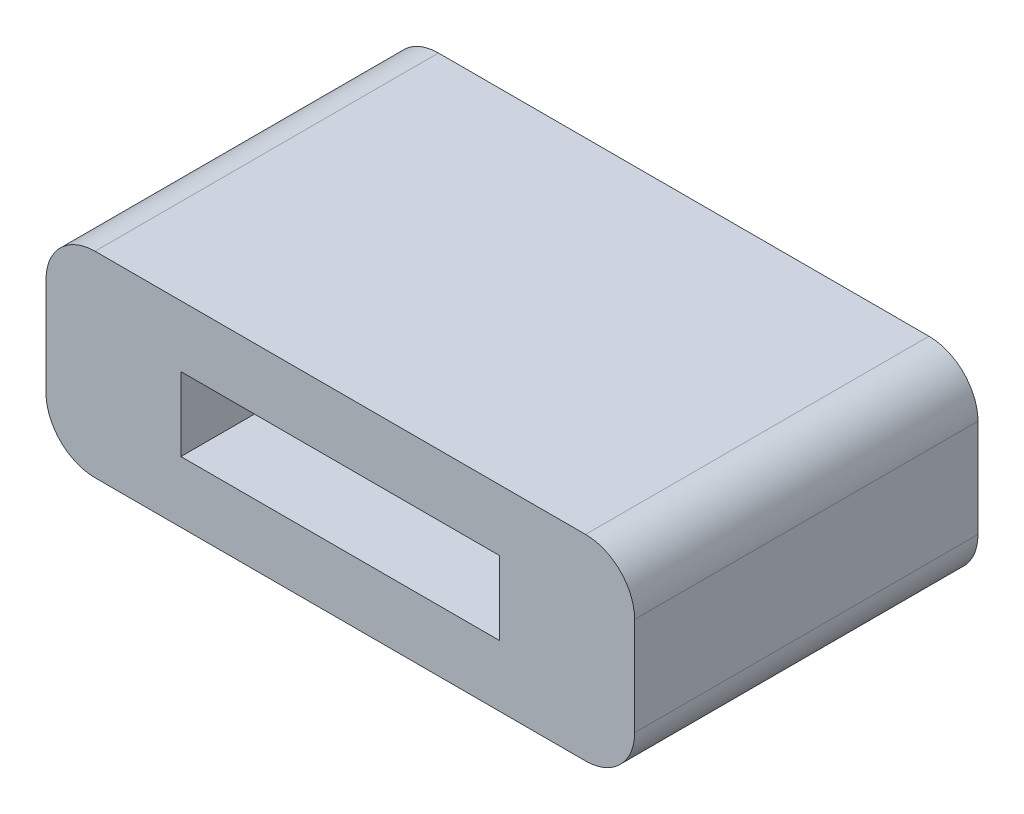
ISO-10303-21;
HEADER;
FILE_DESCRIPTION(('STEP AP214'),'2;1');
FILE_NAME('part.step','',(''),(''),'','','');
FILE_SCHEMA(('AUTOMOTIVE_DESIGN { 1 0 10303 214 1 1 1 1 }'));
ENDSEC;
DATA;
#1=APPLICATION_CONTEXT('core data for automotive mechanical design processes');
#2=APPLICATION_PROTOCOL_DEFINITION('international standard','automotive_design',2000,#1);
#3=PRODUCT_CONTEXT('',#1,'mechanical');
#4=PRODUCT('Part','Part','',(#3));
#5=PRODUCT_RELATED_PRODUCT_CATEGORY('part','',(#4));
#6=PRODUCT_DEFINITION_FORMATION('','',#4);
#7=PRODUCT_DEFINITION_CONTEXT('part definition',#1,'design');
#8=PRODUCT_DEFINITION('design','',#6,#7);
#9=PRODUCT_DEFINITION_SHAPE('','',#8);
#10=(LENGTH_UNIT() NAMED_UNIT(*) SI_UNIT(.MILLI.,.METRE.));
#11=(NAMED_UNIT(*) PLANE_ANGLE_UNIT() SI_UNIT($,.RADIAN.));
#12=(NAMED_UNIT(*) SI_UNIT($,.STERADIAN.) SOLID_ANGLE_UNIT());
#13=UNCERTAINTY_MEASURE_WITH_UNIT(LENGTH_MEASURE(1.E-05),#10,'distance_accuracy_value','');
#14=(GEOMETRIC_REPRESENTATION_CONTEXT(3) GLOBAL_UNCERTAINTY_ASSIGNED_CONTEXT((#13)) GLOBAL_UNIT_ASSIGNED_CONTEXT((#10,
#11,#12)) REPRESENTATION_CONTEXT('',''));
#15=CARTESIAN_POINT('',(0.,0.,0.));
#16=DIRECTION('',(0.,0.,1.));
#17=DIRECTION('',(1.,0.,0.));
#18=AXIS2_PLACEMENT_3D('',#15,#16,#17);
#19=CARTESIAN_POINT('',(-5.,1.,-7.));
#20=DIRECTION('',(0.,0.,1.));
#21=DIRECTION('',(1.,0.,0.));
#22=AXIS2_PLACEMENT_3D('',#19,#20,#21);
#23=PLANE('',#22);
#24=CARTESIAN_POINT('',(-5.,1.,-7.));
#25=DIRECTION('',(0.,0.,1.));
#26=DIRECTION('',(1.,0.,0.));
#27=AXIS2_PLACEMENT_3D('',#24,#25,#26);
#28=CIRCLE('',#27,1.);
#29=CARTESIAN_POINT('',(-5.,2.,-7.));
#30=VERTEX_POINT('',#29);
#31=CARTESIAN_POINT('',(-6.,1.,-7.));
#32=VERTEX_POINT('',#31);
#33=EDGE_CURVE('E212',#30,#32,#28,.T.);
#34=ORIENTED_EDGE('',*,*,#33,.F.);
#35=DIRECTION('',(-1.,0.,0.));
#36=VECTOR('',#35,1.);
#37=CARTESIAN_POINT('',(-5.,2.,-7.));
#38=LINE('',#37,#36);
#39=CARTESIAN_POINT('',(5.,2.,-7.));
#40=VERTEX_POINT('',#39);
#41=EDGE_CURVE('E233',#40,#30,#38,.T.);
#42=ORIENTED_EDGE('',*,*,#41,.F.);
#43=CARTESIAN_POINT('',(5.,1.,-7.));
#44=DIRECTION('',(0.,0.,1.));
#45=DIRECTION('',(-1.,0.,0.));
#46=AXIS2_PLACEMENT_3D('',#43,#44,#45);
#47=CIRCLE('',#46,1.);
#48=CARTESIAN_POINT('',(6.,1.,-7.));
#49=VERTEX_POINT('',#48);
#50=EDGE_CURVE('E230',#49,#40,#47,.T.);
#51=ORIENTED_EDGE('',*,*,#50,.F.);
#52=DIRECTION('',(0.,1.,0.));
#53=VECTOR('',#52,1.);
#54=CARTESIAN_POINT('',(6.,1.,-7.));
#55=LINE('',#54,#53);
#56=CARTESIAN_POINT('',(6.,-1.,-7.));
#57=VERTEX_POINT('',#56);
#58=EDGE_CURVE('E227',#57,#49,#55,.T.);
#59=ORIENTED_EDGE('',*,*,#58,.F.);
#60=CARTESIAN_POINT('',(5.,-1.,-7.));
#61=DIRECTION('',(0.,0.,1.));
#62=DIRECTION('',(1.,0.,0.));
#63=AXIS2_PLACEMENT_3D('',#60,#61,#62);
#64=CIRCLE('',#63,1.);
#65=CARTESIAN_POINT('',(5.,-2.,-7.));
#66=VERTEX_POINT('',#65);
#67=EDGE_CURVE('E224',#66,#57,#64,.T.);
#68=ORIENTED_EDGE('',*,*,#67,.F.);
#69=DIRECTION('',(1.,0.,0.));
#70=VECTOR('',#69,1.);
#71=CARTESIAN_POINT('',(-5.,-2.,-7.));
#72=LINE('',#71,#70);
#73=CARTESIAN_POINT('',(-5.,-2.,-7.));
#74=VERTEX_POINT('',#73);
#75=EDGE_CURVE('E221',#74,#66,#72,.T.);
#76=ORIENTED_EDGE('',*,*,#75,.F.);
#77=CARTESIAN_POINT('',(-5.,-1.,-7.));
#78=DIRECTION('',(0.,0.,1.));
#79=DIRECTION('',(1.,0.,0.));
#80=AXIS2_PLACEMENT_3D('',#77,#78,#79);
#81=CIRCLE('',#80,1.);
#82=CARTESIAN_POINT('',(-6.,-1.,-7.));
#83=VERTEX_POINT('',#82);
#84=EDGE_CURVE('E218',#83,#74,#81,.T.);
#85=ORIENTED_EDGE('',*,*,#84,.F.);
#86=DIRECTION('',(0.,-1.,0.));
#87=VECTOR('',#86,1.);
#88=CARTESIAN_POINT('',(-6.,1.,-7.));
#89=LINE('',#88,#87);
#90=EDGE_CURVE('E215',#32,#83,#89,.T.);
#91=ORIENTED_EDGE('',*,*,#90,.F.);
#92=EDGE_LOOP('',(#34,#42,#51,#59,#68,#76,#85,#91));
#93=FACE_BOUND('',#92,.T.);
#94=DIRECTION('',(1.,0.,0.));
#95=VECTOR('',#94,1.);
#96=CARTESIAN_POINT('',(3.25,0.75,-7.));
#97=LINE('',#96,#95);
#98=CARTESIAN_POINT('',(-3.25,0.75,-7.));
#99=VERTEX_POINT('',#98);
#100=CARTESIAN_POINT('',(3.25,0.75,-7.));
#101=VERTEX_POINT('',#100);
#102=EDGE_CURVE('E130',#99,#101,#97,.T.);
#103=ORIENTED_EDGE('',*,*,#102,.F.);
#104=DIRECTION('',(0.,1.,0.));
#105=VECTOR('',#104,1.);
#106=CARTESIAN_POINT('',(-3.25,0.75,-7.));
#107=LINE('',#106,#105);
#108=CARTESIAN_POINT('',(-3.25,-0.75,-7.));
#109=VERTEX_POINT('',#108);
#110=EDGE_CURVE('E132',#109,#99,#107,.T.);
#111=ORIENTED_EDGE('',*,*,#110,.F.);
#112=DIRECTION('',(-1.,0.,0.));
#113=VECTOR('',#112,1.);
#114=CARTESIAN_POINT('',(-3.25,-0.75,-7.));
#115=LINE('',#114,#113);
#116=CARTESIAN_POINT('',(3.25,-0.75,-7.));
#117=VERTEX_POINT('',#116);
#118=EDGE_CURVE('E48',#117,#109,#115,.T.);
#119=ORIENTED_EDGE('',*,*,#118,.F.);
#120=DIRECTION('',(0.,-1.,0.));
#121=VECTOR('',#120,1.);
#122=CARTESIAN_POINT('',(3.25,-0.75,-7.));
#123=LINE('',#122,#121);
#124=EDGE_CURVE('E43',#101,#117,#123,.T.);
#125=ORIENTED_EDGE('',*,*,#124,.F.);
#126=EDGE_LOOP('',(#103,#111,#119,#125));
#127=FACE_BOUND('',#126,.T.);
#128=ADVANCED_FACE('F26',(#93,#127),#23,.F.);
#129=CARTESIAN_POINT('',(-5.,1.,-7.));
#130=DIRECTION('',(0.,0.,1.));
#131=DIRECTION('',(1.,0.,0.));
#132=AXIS2_PLACEMENT_3D('',#129,#130,#131);
#133=CYLINDRICAL_SURFACE('',#132,1.);
#134=CARTESIAN_POINT('',(-5.,1.,0.));
#135=DIRECTION('',(0.,0.,1.));
#136=DIRECTION('',(1.,0.,0.));
#137=AXIS2_PLACEMENT_3D('',#134,#135,#136);
#138=CIRCLE('',#137,1.);
#139=CARTESIAN_POINT('',(-5.,2.,0.));
#140=VERTEX_POINT('',#139);
#141=CARTESIAN_POINT('',(-6.,1.,0.));
#142=VERTEX_POINT('',#141);
#143=EDGE_CURVE('E182',#140,#142,#138,.T.);
#144=ORIENTED_EDGE('',*,*,#143,.F.);
#145=DIRECTION('',(0.,0.,1.));
#146=VECTOR('',#145,1.);
#147=CARTESIAN_POINT('',(-5.,2.,-7.));
#148=LINE('',#147,#146);
#149=EDGE_CURVE('E11',#30,#140,#148,.T.);
#150=ORIENTED_EDGE('',*,*,#149,.F.);
#151=ORIENTED_EDGE('',*,*,#33,.T.);
#152=DIRECTION('',(0.,0.,1.));
#153=VECTOR('',#152,1.);
#154=CARTESIAN_POINT('',(-6.,1.,-7.));
#155=LINE('',#154,#153);
#156=EDGE_CURVE('E30',#32,#142,#155,.T.);
#157=ORIENTED_EDGE('',*,*,#156,.T.);
#158=EDGE_LOOP('',(#144,#150,#151,#157));
#159=FACE_BOUND('',#158,.T.);
#160=ADVANCED_FACE('F28',(#159),#133,.T.);
#161=CARTESIAN_POINT('',(-5.,2.,-7.));
#162=DIRECTION('',(0.,1.,0.));
#163=DIRECTION('',(0.,0.,1.));
#164=AXIS2_PLACEMENT_3D('',#161,#162,#163);
#165=PLANE('',#164);
#166=DIRECTION('',(-1.,0.,0.));
#167=VECTOR('',#166,1.);
#168=CARTESIAN_POINT('',(-5.,2.,0.));
#169=LINE('',#168,#167);
#170=CARTESIAN_POINT('',(5.,2.,0.));
#171=VERTEX_POINT('',#170);
#172=EDGE_CURVE('E209',#171,#140,#169,.T.);
#173=ORIENTED_EDGE('',*,*,#172,.F.);
#174=DIRECTION('',(0.,0.,1.));
#175=VECTOR('',#174,1.);
#176=CARTESIAN_POINT('',(5.,2.,-7.));
#177=LINE('',#176,#175);
#178=EDGE_CURVE('E35',#40,#171,#177,.T.);
#179=ORIENTED_EDGE('',*,*,#178,.F.);
#180=ORIENTED_EDGE('',*,*,#41,.T.);
#181=ORIENTED_EDGE('',*,*,#149,.T.);
#182=EDGE_LOOP('',(#173,#179,#180,#181));
#183=FACE_BOUND('',#182,.T.);
#184=ADVANCED_FACE('F258',(#183),#165,.T.);
#185=CARTESIAN_POINT('',(5.,1.,-7.));
#186=DIRECTION('',(0.,0.,1.));
#187=DIRECTION('',(1.,0.,0.));
#188=AXIS2_PLACEMENT_3D('',#185,#186,#187);
#189=CYLINDRICAL_SURFACE('',#188,1.);
#190=CARTESIAN_POINT('',(5.,1.,0.));
#191=DIRECTION('',(0.,0.,1.));
#192=DIRECTION('',(-1.,0.,0.));
#193=AXIS2_PLACEMENT_3D('',#190,#191,#192);
#194=CIRCLE('',#193,1.);
#195=CARTESIAN_POINT('',(6.,1.,0.));
#196=VERTEX_POINT('',#195);
#197=EDGE_CURVE('E206',#196,#171,#194,.T.);
#198=ORIENTED_EDGE('',*,*,#197,.F.);
#199=DIRECTION('',(0.,0.,1.));
#200=VECTOR('',#199,1.);
#201=CARTESIAN_POINT('',(6.,1.,-7.));
#202=LINE('',#201,#200);
#203=EDGE_CURVE('E237',#49,#196,#202,.T.);
#204=ORIENTED_EDGE('',*,*,#203,.F.);
#205=ORIENTED_EDGE('',*,*,#50,.T.);
#206=ORIENTED_EDGE('',*,*,#178,.T.);
#207=EDGE_LOOP('',(#198,#204,#205,#206));
#208=FACE_BOUND('',#207,.T.);
#209=ADVANCED_FACE('F278',(#208),#189,.T.);
#210=CARTESIAN_POINT('',(6.,1.,-7.));
#211=DIRECTION('',(1.,0.,0.));
#212=DIRECTION('',(0.,0.,-1.));
#213=AXIS2_PLACEMENT_3D('',#210,#211,#212);
#214=PLANE('',#213);
#215=DIRECTION('',(0.,1.,0.));
#216=VECTOR('',#215,1.);
#217=CARTESIAN_POINT('',(6.,1.,0.));
#218=LINE('',#217,#216);
#219=CARTESIAN_POINT('',(6.,-1.,0.));
#220=VERTEX_POINT('',#219);
#221=EDGE_CURVE('E203',#220,#196,#218,.T.);
#222=ORIENTED_EDGE('',*,*,#221,.F.);
#223=DIRECTION('',(0.,0.,1.));
#224=VECTOR('',#223,1.);
#225=CARTESIAN_POINT('',(6.,-1.,-7.));
#226=LINE('',#225,#224);
#227=EDGE_CURVE('E239',#57,#220,#226,.T.);
#228=ORIENTED_EDGE('',*,*,#227,.F.);
#229=ORIENTED_EDGE('',*,*,#58,.T.);
#230=ORIENTED_EDGE('',*,*,#203,.T.);
#231=EDGE_LOOP('',(#222,#228,#229,#230));
#232=FACE_BOUND('',#231,.T.);
#233=ADVANCED_FACE('F276',(#232),#214,.T.);
#234=CARTESIAN_POINT('',(5.,-1.,-7.));
#235=DIRECTION('',(0.,0.,1.));
#236=DIRECTION('',(1.,0.,0.));
#237=AXIS2_PLACEMENT_3D('',#234,#235,#236);
#238=CYLINDRICAL_SURFACE('',#237,1.);
#239=CARTESIAN_POINT('',(5.,-1.,0.));
#240=DIRECTION('',(0.,0.,1.));
#241=DIRECTION('',(1.,0.,0.));
#242=AXIS2_PLACEMENT_3D('',#239,#240,#241);
#243=CIRCLE('',#242,1.);
#244=CARTESIAN_POINT('',(5.,-2.,0.));
#245=VERTEX_POINT('',#244);
#246=EDGE_CURVE('E200',#245,#220,#243,.T.);
#247=ORIENTED_EDGE('',*,*,#246,.F.);
#248=DIRECTION('',(0.,0.,1.));
#249=VECTOR('',#248,1.);
#250=CARTESIAN_POINT('',(5.,-2.,-7.));
#251=LINE('',#250,#249);
#252=EDGE_CURVE('E241',#66,#245,#251,.T.);
#253=ORIENTED_EDGE('',*,*,#252,.F.);
#254=ORIENTED_EDGE('',*,*,#67,.T.);
#255=ORIENTED_EDGE('',*,*,#227,.T.);
#256=EDGE_LOOP('',(#247,#253,#254,#255));
#257=FACE_BOUND('',#256,.T.);
#258=ADVANCED_FACE('F272',(#257),#238,.T.);
#259=CARTESIAN_POINT('',(-5.,-2.,-7.));
#260=DIRECTION('',(0.,-1.,0.));
#261=DIRECTION('',(0.,0.,-1.));
#262=AXIS2_PLACEMENT_3D('',#259,#260,#261);
#263=PLANE('',#262);
#264=DIRECTION('',(1.,0.,0.));
#265=VECTOR('',#264,1.);
#266=CARTESIAN_POINT('',(-5.,-2.,0.));
#267=LINE('',#266,#265);
#268=CARTESIAN_POINT('',(-5.,-2.,0.));
#269=VERTEX_POINT('',#268);
#270=EDGE_CURVE('E197',#269,#245,#267,.T.);
#271=ORIENTED_EDGE('',*,*,#270,.F.);
#272=DIRECTION('',(0.,0.,1.));
#273=VECTOR('',#272,1.);
#274=CARTESIAN_POINT('',(-5.,-2.,-7.));
#275=LINE('',#274,#273);
#276=EDGE_CURVE('E243',#74,#269,#275,.T.);
#277=ORIENTED_EDGE('',*,*,#276,.F.);
#278=ORIENTED_EDGE('',*,*,#75,.T.);
#279=ORIENTED_EDGE('',*,*,#252,.T.);
#280=EDGE_LOOP('',(#271,#277,#278,#279));
#281=FACE_BOUND('',#280,.T.);
#282=ADVANCED_FACE('F270',(#281),#263,.T.);
#283=CARTESIAN_POINT('',(-5.,-1.,-7.));
#284=DIRECTION('',(0.,0.,1.));
#285=DIRECTION('',(1.,0.,0.));
#286=AXIS2_PLACEMENT_3D('',#283,#284,#285);
#287=CYLINDRICAL_SURFACE('',#286,1.);
#288=CARTESIAN_POINT('',(-5.,-1.,0.));
#289=DIRECTION('',(0.,0.,1.));
#290=DIRECTION('',(1.,0.,0.));
#291=AXIS2_PLACEMENT_3D('',#288,#289,#290);
#292=CIRCLE('',#291,1.);
#293=CARTESIAN_POINT('',(-6.,-1.,0.));
#294=VERTEX_POINT('',#293);
#295=EDGE_CURVE('E194',#294,#269,#292,.T.);
#296=ORIENTED_EDGE('',*,*,#295,.F.);
#297=DIRECTION('',(0.,0.,1.));
#298=VECTOR('',#297,1.);
#299=CARTESIAN_POINT('',(-6.,-1.,-7.));
#300=LINE('',#299,#298);
#301=EDGE_CURVE('E244',#83,#294,#300,.T.);
#302=ORIENTED_EDGE('',*,*,#301,.F.);
#303=ORIENTED_EDGE('',*,*,#84,.T.);
#304=ORIENTED_EDGE('',*,*,#276,.T.);
#305=EDGE_LOOP('',(#296,#302,#303,#304));
#306=FACE_BOUND('',#305,.T.);
#307=ADVANCED_FACE('F266',(#306),#287,.T.);
#308=CARTESIAN_POINT('',(-6.,1.,-7.));
#309=DIRECTION('',(-1.,0.,0.));
#310=DIRECTION('',(0.,-1.,0.));
#311=AXIS2_PLACEMENT_3D('',#308,#309,#310);
#312=PLANE('',#311);
#313=DIRECTION('',(0.,-1.,0.));
#314=VECTOR('',#313,1.);
#315=CARTESIAN_POINT('',(-6.,1.,0.));
#316=LINE('',#315,#314);
#317=EDGE_CURVE('E191',#142,#294,#316,.T.);
#318=ORIENTED_EDGE('',*,*,#317,.F.);
#319=ORIENTED_EDGE('',*,*,#156,.F.);
#320=ORIENTED_EDGE('',*,*,#90,.T.);
#321=ORIENTED_EDGE('',*,*,#301,.T.);
#322=EDGE_LOOP('',(#318,#319,#320,#321));
#323=FACE_BOUND('',#322,.T.);
#324=ADVANCED_FACE('F252',(#323),#312,.T.);
#325=CARTESIAN_POINT('',(-5.,1.,0.));
#326=DIRECTION('',(0.,0.,1.));
#327=DIRECTION('',(1.,0.,0.));
#328=AXIS2_PLACEMENT_3D('',#325,#326,#327);
#329=PLANE('',#328);
#330=DIRECTION('',(-1.,0.,0.));
#331=VECTOR('',#330,1.);
#332=CARTESIAN_POINT('',(3.25,0.75,0.));
#333=LINE('',#332,#331);
#334=CARTESIAN_POINT('',(3.25,0.75,0.));
#335=VERTEX_POINT('',#334);
#336=CARTESIAN_POINT('',(-3.25,0.75,0.));
#337=VERTEX_POINT('',#336);
#338=EDGE_CURVE('E156',#335,#337,#333,.T.);
#339=ORIENTED_EDGE('',*,*,#338,.F.);
#340=DIRECTION('',(0.,1.,0.));
#341=VECTOR('',#340,1.);
#342=CARTESIAN_POINT('',(3.25,-0.75,0.));
#343=LINE('',#342,#341);
#344=CARTESIAN_POINT('',(3.25,-0.75,0.));
#345=VERTEX_POINT('',#344);
#346=EDGE_CURVE('E164',#345,#335,#343,.T.);
#347=ORIENTED_EDGE('',*,*,#346,.F.);
#348=DIRECTION('',(1.,0.,0.));
#349=VECTOR('',#348,1.);
#350=CARTESIAN_POINT('',(-3.25,-0.75,0.));
#351=LINE('',#350,#349);
#352=CARTESIAN_POINT('',(-3.25,-0.75,0.));
#353=VERTEX_POINT('',#352);
#354=EDGE_CURVE('E161',#353,#345,#351,.T.);
#355=ORIENTED_EDGE('',*,*,#354,.F.);
#356=DIRECTION('',(0.,-1.,0.));
#357=VECTOR('',#356,1.);
#358=CARTESIAN_POINT('',(-3.25,0.75,0.));
#359=LINE('',#358,#357);
#360=EDGE_CURVE('E158',#337,#353,#359,.T.);
#361=ORIENTED_EDGE('',*,*,#360,.F.);
#362=EDGE_LOOP('',(#339,#347,#355,#361));
#363=FACE_BOUND('',#362,.T.);
#364=ORIENTED_EDGE('',*,*,#143,.T.);
#365=ORIENTED_EDGE('',*,*,#317,.T.);
#366=ORIENTED_EDGE('',*,*,#295,.T.);
#367=ORIENTED_EDGE('',*,*,#270,.T.);
#368=ORIENTED_EDGE('',*,*,#246,.T.);
#369=ORIENTED_EDGE('',*,*,#221,.T.);
#370=ORIENTED_EDGE('',*,*,#197,.T.);
#371=ORIENTED_EDGE('',*,*,#172,.T.);
#372=EDGE_LOOP('',(#364,#365,#366,#367,#368,#369,#370,#371));
#373=FACE_BOUND('',#372,.T.);
#374=ADVANCED_FACE('F254',(#363,#373),#329,.T.);
#375=CARTESIAN_POINT('',(3.25,0.75,-4.));
#376=DIRECTION('',(0.,1.,0.));
#377=DIRECTION('',(0.,0.,1.));
#378=AXIS2_PLACEMENT_3D('',#375,#376,#377);
#379=PLANE('',#378);
#380=ORIENTED_EDGE('',*,*,#338,.T.);
#381=DIRECTION('',(0.,0.,1.));
#382=VECTOR('',#381,1.);
#383=CARTESIAN_POINT('',(-3.25,0.75,-4.));
#384=LINE('',#383,#382);
#385=CARTESIAN_POINT('',(-3.25,0.75,-4.));
#386=VERTEX_POINT('',#385);
#387=EDGE_CURVE('E179',#386,#337,#384,.T.);
#388=ORIENTED_EDGE('',*,*,#387,.F.);
#389=DIRECTION('',(-1.,0.,0.));
#390=VECTOR('',#389,1.);
#391=CARTESIAN_POINT('',(3.25,0.75,-4.));
#392=LINE('',#391,#390);
#393=CARTESIAN_POINT('',(3.25,0.75,-4.));
#394=VERTEX_POINT('',#393);
#395=EDGE_CURVE('E167',#394,#386,#392,.T.);
#396=ORIENTED_EDGE('',*,*,#395,.F.);
#397=DIRECTION('',(0.,0.,1.));
#398=VECTOR('',#397,1.);
#399=CARTESIAN_POINT('',(3.25,0.75,-4.));
#400=LINE('',#399,#398);
#401=EDGE_CURVE('E180',#394,#335,#400,.T.);
#402=ORIENTED_EDGE('',*,*,#401,.T.);
#403=EDGE_LOOP('',(#380,#388,#396,#402));
#404=FACE_BOUND('',#403,.T.);
#405=ADVANCED_FACE('F297',(#404),#379,.F.);
#406=CARTESIAN_POINT('',(3.25,-0.75,-4.));
#407=DIRECTION('',(1.,0.,0.));
#408=DIRECTION('',(0.,1.,0.));
#409=AXIS2_PLACEMENT_3D('',#406,#407,#408);
#410=PLANE('',#409);
#411=ORIENTED_EDGE('',*,*,#346,.T.);
#412=ORIENTED_EDGE('',*,*,#401,.F.);
#413=DIRECTION('',(0.,1.,0.));
#414=VECTOR('',#413,1.);
#415=CARTESIAN_POINT('',(3.25,-0.75,-4.));
#416=LINE('',#415,#414);
#417=CARTESIAN_POINT('',(3.25,-0.75,-4.));
#418=VERTEX_POINT('',#417);
#419=EDGE_CURVE('E176',#418,#394,#416,.T.);
#420=ORIENTED_EDGE('',*,*,#419,.F.);
#421=DIRECTION('',(0.,0.,1.));
#422=VECTOR('',#421,1.);
#423=CARTESIAN_POINT('',(3.25,-0.75,-4.));
#424=LINE('',#423,#422);
#425=EDGE_CURVE('E183',#418,#345,#424,.T.);
#426=ORIENTED_EDGE('',*,*,#425,.T.);
#427=EDGE_LOOP('',(#411,#412,#420,#426));
#428=FACE_BOUND('',#427,.T.);
#429=ADVANCED_FACE('F301',(#428),#410,.F.);
#430=CARTESIAN_POINT('',(-3.25,-0.75,-4.));
#431=DIRECTION('',(0.,-1.,0.));
#432=DIRECTION('',(0.,0.,-1.));
#433=AXIS2_PLACEMENT_3D('',#430,#431,#432);
#434=PLANE('',#433);
#435=ORIENTED_EDGE('',*,*,#354,.T.);
#436=ORIENTED_EDGE('',*,*,#425,.F.);
#437=DIRECTION('',(1.,0.,0.));
#438=VECTOR('',#437,1.);
#439=CARTESIAN_POINT('',(-3.25,-0.75,-4.));
#440=LINE('',#439,#438);
#441=CARTESIAN_POINT('',(-3.25,-0.75,-4.));
#442=VERTEX_POINT('',#441);
#443=EDGE_CURVE('E173',#442,#418,#440,.T.);
#444=ORIENTED_EDGE('',*,*,#443,.F.);
#445=DIRECTION('',(0.,0.,1.));
#446=VECTOR('',#445,1.);
#447=CARTESIAN_POINT('',(-3.25,-0.75,-4.));
#448=LINE('',#447,#446);
#449=EDGE_CURVE('E185',#442,#353,#448,.T.);
#450=ORIENTED_EDGE('',*,*,#449,.T.);
#451=EDGE_LOOP('',(#435,#436,#444,#450));
#452=FACE_BOUND('',#451,.T.);
#453=ADVANCED_FACE('F307',(#452),#434,.F.);
#454=CARTESIAN_POINT('',(-3.25,0.75,-4.));
#455=DIRECTION('',(-1.,0.,0.));
#456=DIRECTION('',(0.,-1.,0.));
#457=AXIS2_PLACEMENT_3D('',#454,#455,#456);
#458=PLANE('',#457);
#459=ORIENTED_EDGE('',*,*,#360,.T.);
#460=ORIENTED_EDGE('',*,*,#449,.F.);
#461=DIRECTION('',(0.,-1.,0.));
#462=VECTOR('',#461,1.);
#463=CARTESIAN_POINT('',(-3.25,0.75,-4.));
#464=LINE('',#463,#462);
#465=EDGE_CURVE('E170',#386,#442,#464,.T.);
#466=ORIENTED_EDGE('',*,*,#465,.F.);
#467=ORIENTED_EDGE('',*,*,#387,.T.);
#468=EDGE_LOOP('',(#459,#460,#466,#467));
#469=FACE_BOUND('',#468,.T.);
#470=ADVANCED_FACE('F303',(#469),#458,.F.);
#471=CARTESIAN_POINT('',(-3.25,0.75,-4.));
#472=DIRECTION('',(0.,0.,1.));
#473=DIRECTION('',(1.,0.,0.));
#474=AXIS2_PLACEMENT_3D('',#471,#472,#473);
#475=PLANE('',#474);
#476=ORIENTED_EDGE('',*,*,#395,.T.);
#477=ORIENTED_EDGE('',*,*,#465,.T.);
#478=ORIENTED_EDGE('',*,*,#443,.T.);
#479=ORIENTED_EDGE('',*,*,#419,.T.);
#480=EDGE_LOOP('',(#476,#477,#478,#479));
#481=FACE_BOUND('',#480,.T.);
#482=ADVANCED_FACE('F306',(#481),#475,.T.);
#483=CARTESIAN_POINT('',(3.25,0.75,-7.));
#484=DIRECTION('',(0.,0.707106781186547,-0.707106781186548));
#485=DIRECTION('',(0.,0.707106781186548,0.707106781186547));
#486=AXIS2_PLACEMENT_3D('',#483,#484,#485);
#487=PLANE('',#486);
#488=DIRECTION('',(0.577350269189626,0.577350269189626,0.577350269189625));
#489=VECTOR('',#488,1.);
#490=CARTESIAN_POINT('',(2.75,0.249999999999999,-7.5));
#491=LINE('',#490,#489);
#492=CARTESIAN_POINT('',(2.5,0.,-7.75));
#493=VERTEX_POINT('',#492);
#494=EDGE_CURVE('E151',#493,#101,#491,.T.);
#495=ORIENTED_EDGE('',*,*,#494,.F.);
#496=DIRECTION('',(-1.,0.,0.));
#497=VECTOR('',#496,1.);
#498=CARTESIAN_POINT('',(3.25,0.,-7.75));
#499=LINE('',#498,#497);
#500=CARTESIAN_POINT('',(-2.5,0.,-7.75));
#501=VERTEX_POINT('',#500);
#502=EDGE_CURVE('E146',#493,#501,#499,.T.);
#503=ORIENTED_EDGE('',*,*,#502,.T.);
#504=DIRECTION('',(-0.577350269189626,0.577350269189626,0.577350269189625));
#505=VECTOR('',#504,1.);
#506=CARTESIAN_POINT('',(-1.08333333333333,-1.41666666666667,-9.16666666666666));
#507=LINE('',#506,#505);
#508=EDGE_CURVE('E141',#501,#99,#507,.T.);
#509=ORIENTED_EDGE('',*,*,#508,.T.);
#510=ORIENTED_EDGE('',*,*,#102,.T.);
#511=EDGE_LOOP('',(#495,#503,#509,#510));
#512=FACE_BOUND('',#511,.T.);
#513=ADVANCED_FACE('F145',(#512),#487,.T.);
#514=CARTESIAN_POINT('',(3.25,-0.75,-7.));
#515=DIRECTION('',(0.707106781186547,0.,-0.707106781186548));
#516=DIRECTION('',(-0.707106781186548,0.,-0.707106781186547));
#517=AXIS2_PLACEMENT_3D('',#514,#515,#516);
#518=PLANE('',#517);
#519=ORIENTED_EDGE('',*,*,#124,.T.);
#520=DIRECTION('',(0.577350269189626,-0.577350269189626,0.577350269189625));
#521=VECTOR('',#520,1.);
#522=CARTESIAN_POINT('',(1.08333333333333,1.41666666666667,-9.16666666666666));
#523=LINE('',#522,#521);
#524=EDGE_CURVE('E148',#493,#117,#523,.T.);
#525=ORIENTED_EDGE('',*,*,#524,.F.);
#526=ORIENTED_EDGE('',*,*,#494,.T.);
#527=EDGE_LOOP('',(#519,#525,#526));
#528=FACE_BOUND('',#527,.T.);
#529=ADVANCED_FACE('F317',(#528),#518,.T.);
#530=CARTESIAN_POINT('',(-3.25,-0.75,-7.));
#531=DIRECTION('',(0.,-0.707106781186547,-0.707106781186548));
#532=DIRECTION('',(0.,0.707106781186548,-0.707106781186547));
#533=AXIS2_PLACEMENT_3D('',#530,#531,#532);
#534=PLANE('',#533);
#535=ORIENTED_EDGE('',*,*,#502,.F.);
#536=ORIENTED_EDGE('',*,*,#524,.T.);
#537=ORIENTED_EDGE('',*,*,#118,.T.);
#538=DIRECTION('',(-0.577350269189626,-0.577350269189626,0.577350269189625));
#539=VECTOR('',#538,1.);
#540=CARTESIAN_POINT('',(-2.75,-0.249999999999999,-7.5));
#541=LINE('',#540,#539);
#542=EDGE_CURVE('E143',#501,#109,#541,.T.);
#543=ORIENTED_EDGE('',*,*,#542,.F.);
#544=EDGE_LOOP('',(#535,#536,#537,#543));
#545=FACE_BOUND('',#544,.T.);
#546=ADVANCED_FACE('F320',(#545),#534,.T.);
#547=CARTESIAN_POINT('',(-3.25,0.75,-7.));
#548=DIRECTION('',(-0.707106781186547,0.,-0.707106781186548));
#549=DIRECTION('',(-0.707106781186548,0.,0.707106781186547));
#550=AXIS2_PLACEMENT_3D('',#547,#548,#549);
#551=PLANE('',#550);
#552=ORIENTED_EDGE('',*,*,#110,.T.);
#553=ORIENTED_EDGE('',*,*,#508,.F.);
#554=ORIENTED_EDGE('',*,*,#542,.T.);
#555=EDGE_LOOP('',(#552,#553,#554));
#556=FACE_BOUND('',#555,.T.);
#557=ADVANCED_FACE('F140',(#556),#551,.T.);
#558=CLOSED_SHELL('',(#128,#160,#184,#209,#233,#258,#282,#307,#324,#374,#405,#429,#453,#470,
#482,#513,#529,#546,#557));
#559=MANIFOLD_SOLID_BREP('B2',#558);
#560=ADVANCED_BREP_SHAPE_REPRESENTATION('',(#18,#559),#14);
#561=SHAPE_DEFINITION_REPRESENTATION(#9,#560);
ENDSEC;
END-ISO-10303-21;
